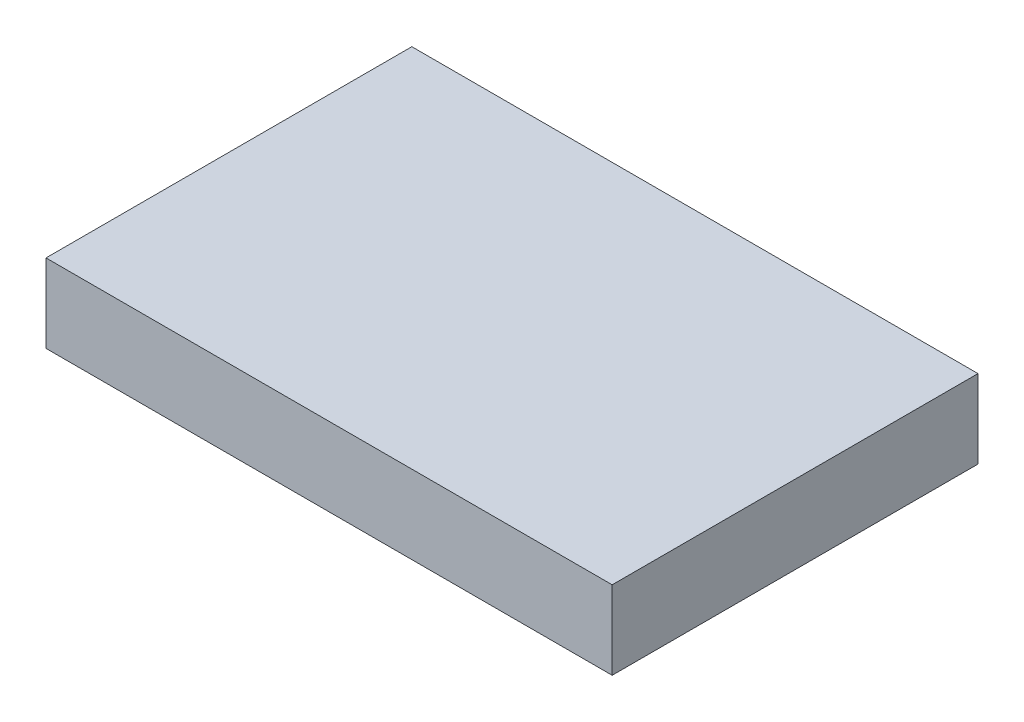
ISO-10303-21;
HEADER;
FILE_DESCRIPTION(('STEP AP214'),'2;1');
FILE_NAME('part.step','',(''),(''),'','','');
FILE_SCHEMA(('AUTOMOTIVE_DESIGN { 1 0 10303 214 1 1 1 1 }'));
ENDSEC;
DATA;
#1=APPLICATION_CONTEXT('core data for automotive mechanical design processes');
#2=APPLICATION_PROTOCOL_DEFINITION('international standard','automotive_design',2000,#1);
#3=PRODUCT_CONTEXT('',#1,'mechanical');
#4=PRODUCT('Part','Part','',(#3));
#5=PRODUCT_RELATED_PRODUCT_CATEGORY('part','',(#4));
#6=PRODUCT_DEFINITION_FORMATION('','',#4);
#7=PRODUCT_DEFINITION_CONTEXT('part definition',#1,'design');
#8=PRODUCT_DEFINITION('design','',#6,#7);
#9=PRODUCT_DEFINITION_SHAPE('','',#8);
#10=(LENGTH_UNIT() NAMED_UNIT(*) SI_UNIT(.MILLI.,.METRE.));
#11=(NAMED_UNIT(*) PLANE_ANGLE_UNIT() SI_UNIT($,.RADIAN.));
#12=(NAMED_UNIT(*) SI_UNIT($,.STERADIAN.) SOLID_ANGLE_UNIT());
#13=UNCERTAINTY_MEASURE_WITH_UNIT(LENGTH_MEASURE(1.E-05),#10,'distance_accuracy_value','');
#14=(GEOMETRIC_REPRESENTATION_CONTEXT(3) GLOBAL_UNCERTAINTY_ASSIGNED_CONTEXT((#13)) GLOBAL_UNIT_ASSIGNED_CONTEXT((#10,
#11,#12)) REPRESENTATION_CONTEXT('',''));
#15=CARTESIAN_POINT('',(0.,0.,0.));
#16=DIRECTION('',(0.,0.,1.));
#17=DIRECTION('',(1.,0.,0.));
#18=AXIS2_PLACEMENT_3D('',#15,#16,#17);
#19=CARTESIAN_POINT('',(0.,9.,0.));
#20=DIRECTION('',(1.,0.,0.));
#21=DIRECTION('',(0.,0.,-1.));
#22=AXIS2_PLACEMENT_3D('',#19,#20,#21);
#23=PLANE('',#22);
#24=DIRECTION('',(0.,0.,1.));
#25=VECTOR('',#24,1.);
#26=CARTESIAN_POINT('',(0.,0.,0.));
#27=LINE('',#26,#25);
#28=CARTESIAN_POINT('',(0.,0.,-42.));
#29=VERTEX_POINT('',#28);
#30=CARTESIAN_POINT('',(0.,0.,0.));
#31=VERTEX_POINT('',#30);
#32=EDGE_CURVE('E100',#29,#31,#27,.T.);
#33=ORIENTED_EDGE('',*,*,#32,.T.);
#34=DIRECTION('',(0.,-1.,0.));
#35=VECTOR('',#34,1.);
#36=CARTESIAN_POINT('',(0.,9.,0.));
#37=LINE('',#36,#35);
#38=CARTESIAN_POINT('',(0.,9.,0.));
#39=VERTEX_POINT('',#38);
#40=EDGE_CURVE('E11',#39,#31,#37,.T.);
#41=ORIENTED_EDGE('',*,*,#40,.F.);
#42=DIRECTION('',(0.,0.,1.));
#43=VECTOR('',#42,1.);
#44=CARTESIAN_POINT('',(0.,9.,0.));
#45=LINE('',#44,#43);
#46=CARTESIAN_POINT('',(0.,9.,-42.));
#47=VERTEX_POINT('',#46);
#48=EDGE_CURVE('E88',#47,#39,#45,.T.);
#49=ORIENTED_EDGE('',*,*,#48,.F.);
#50=DIRECTION('',(0.,-1.,0.));
#51=VECTOR('',#50,1.);
#52=CARTESIAN_POINT('',(0.,9.,-42.));
#53=LINE('',#52,#51);
#54=EDGE_CURVE('E96',#47,#29,#53,.T.);
#55=ORIENTED_EDGE('',*,*,#54,.T.);
#56=EDGE_LOOP('',(#33,#41,#49,#55));
#57=FACE_BOUND('',#56,.T.);
#58=ADVANCED_FACE('F37',(#57),#23,.F.);
#59=CARTESIAN_POINT('',(0.,9.,0.));
#60=DIRECTION('',(0.,0.,-1.));
#61=DIRECTION('',(-1.,0.,0.));
#62=AXIS2_PLACEMENT_3D('',#59,#60,#61);
#63=PLANE('',#62);
#64=DIRECTION('',(1.,0.,0.));
#65=VECTOR('',#64,1.);
#66=CARTESIAN_POINT('',(0.,0.,0.));
#67=LINE('',#66,#65);
#68=CARTESIAN_POINT('',(65.000000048,0.,0.));
#69=VERTEX_POINT('',#68);
#70=EDGE_CURVE('E92',#31,#69,#67,.T.);
#71=ORIENTED_EDGE('',*,*,#70,.T.);
#72=DIRECTION('',(0.,-1.,0.));
#73=VECTOR('',#72,1.);
#74=CARTESIAN_POINT('',(65.000000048,9.,0.));
#75=LINE('',#74,#73);
#76=CARTESIAN_POINT('',(65.000000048,9.,0.));
#77=VERTEX_POINT('',#76);
#78=EDGE_CURVE('E45',#77,#69,#75,.T.);
#79=ORIENTED_EDGE('',*,*,#78,.F.);
#80=DIRECTION('',(1.,0.,0.));
#81=VECTOR('',#80,1.);
#82=CARTESIAN_POINT('',(0.,9.,0.));
#83=LINE('',#82,#81);
#84=EDGE_CURVE('E83',#39,#77,#83,.T.);
#85=ORIENTED_EDGE('',*,*,#84,.F.);
#86=ORIENTED_EDGE('',*,*,#40,.T.);
#87=EDGE_LOOP('',(#71,#79,#85,#86));
#88=FACE_BOUND('',#87,.T.);
#89=ADVANCED_FACE('F91',(#88),#63,.F.);
#90=CARTESIAN_POINT('',(65.000000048,9.,0.));
#91=DIRECTION('',(-1.,0.,0.));
#92=DIRECTION('',(0.,0.,1.));
#93=AXIS2_PLACEMENT_3D('',#90,#91,#92);
#94=PLANE('',#93);
#95=DIRECTION('',(0.,0.,-1.));
#96=VECTOR('',#95,1.);
#97=CARTESIAN_POINT('',(65.000000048,0.,0.));
#98=LINE('',#97,#96);
#99=CARTESIAN_POINT('',(65.000000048,0.,-42.));
#100=VERTEX_POINT('',#99);
#101=EDGE_CURVE('E70',#69,#100,#98,.T.);
#102=ORIENTED_EDGE('',*,*,#101,.T.);
#103=DIRECTION('',(0.,-1.,0.));
#104=VECTOR('',#103,1.);
#105=CARTESIAN_POINT('',(65.000000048,9.,-42.));
#106=LINE('',#105,#104);
#107=CARTESIAN_POINT('',(65.000000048,9.,-42.));
#108=VERTEX_POINT('',#107);
#109=EDGE_CURVE('E93',#108,#100,#106,.T.);
#110=ORIENTED_EDGE('',*,*,#109,.F.);
#111=DIRECTION('',(0.,0.,-1.));
#112=VECTOR('',#111,1.);
#113=CARTESIAN_POINT('',(65.000000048,9.,0.));
#114=LINE('',#113,#112);
#115=EDGE_CURVE('E86',#77,#108,#114,.T.);
#116=ORIENTED_EDGE('',*,*,#115,.F.);
#117=ORIENTED_EDGE('',*,*,#78,.T.);
#118=EDGE_LOOP('',(#102,#110,#116,#117));
#119=FACE_BOUND('',#118,.T.);
#120=ADVANCED_FACE('F94',(#119),#94,.F.);
#121=CARTESIAN_POINT('',(0.,9.,-42.));
#122=DIRECTION('',(0.,0.,1.));
#123=DIRECTION('',(1.,0.,0.));
#124=AXIS2_PLACEMENT_3D('',#121,#122,#123);
#125=PLANE('',#124);
#126=DIRECTION('',(-1.,0.,0.));
#127=VECTOR('',#126,1.);
#128=CARTESIAN_POINT('',(0.,0.,-42.));
#129=LINE('',#128,#127);
#130=EDGE_CURVE('E76',#100,#29,#129,.T.);
#131=ORIENTED_EDGE('',*,*,#130,.T.);
#132=ORIENTED_EDGE('',*,*,#54,.F.);
#133=DIRECTION('',(-1.,0.,0.));
#134=VECTOR('',#133,1.);
#135=CARTESIAN_POINT('',(0.,9.,-42.));
#136=LINE('',#135,#134);
#137=EDGE_CURVE('E53',#108,#47,#136,.T.);
#138=ORIENTED_EDGE('',*,*,#137,.F.);
#139=ORIENTED_EDGE('',*,*,#109,.T.);
#140=EDGE_LOOP('',(#131,#132,#138,#139));
#141=FACE_BOUND('',#140,.T.);
#142=ADVANCED_FACE('F107',(#141),#125,.F.);
#143=CARTESIAN_POINT('',(0.,9.,0.));
#144=DIRECTION('',(0.,-1.,0.));
#145=DIRECTION('',(0.,0.,-1.));
#146=AXIS2_PLACEMENT_3D('',#143,#144,#145);
#147=PLANE('',#146);
#148=ORIENTED_EDGE('',*,*,#48,.T.);
#149=ORIENTED_EDGE('',*,*,#84,.T.);
#150=ORIENTED_EDGE('',*,*,#115,.T.);
#151=ORIENTED_EDGE('',*,*,#137,.T.);
#152=EDGE_LOOP('',(#148,#149,#150,#151));
#153=FACE_BOUND('',#152,.T.);
#154=ADVANCED_FACE('F84',(#153),#147,.F.);
#155=CARTESIAN_POINT('',(0.,0.,0.));
#156=DIRECTION('',(0.,-1.,0.));
#157=DIRECTION('',(0.,0.,-1.));
#158=AXIS2_PLACEMENT_3D('',#155,#156,#157);
#159=PLANE('',#158);
#160=ORIENTED_EDGE('',*,*,#32,.F.);
#161=ORIENTED_EDGE('',*,*,#130,.F.);
#162=ORIENTED_EDGE('',*,*,#101,.F.);
#163=ORIENTED_EDGE('',*,*,#70,.F.);
#164=EDGE_LOOP('',(#160,#161,#162,#163));
#165=FACE_BOUND('',#164,.T.);
#166=ADVANCED_FACE('F110',(#165),#159,.T.);
#167=CLOSED_SHELL('',(#58,#89,#120,#142,#154,#166));
#168=MANIFOLD_SOLID_BREP('B2',#167);
#169=ADVANCED_BREP_SHAPE_REPRESENTATION('',(#18,#168),#14);
#170=SHAPE_DEFINITION_REPRESENTATION(#9,#169);
ENDSEC;
END-ISO-10303-21;
